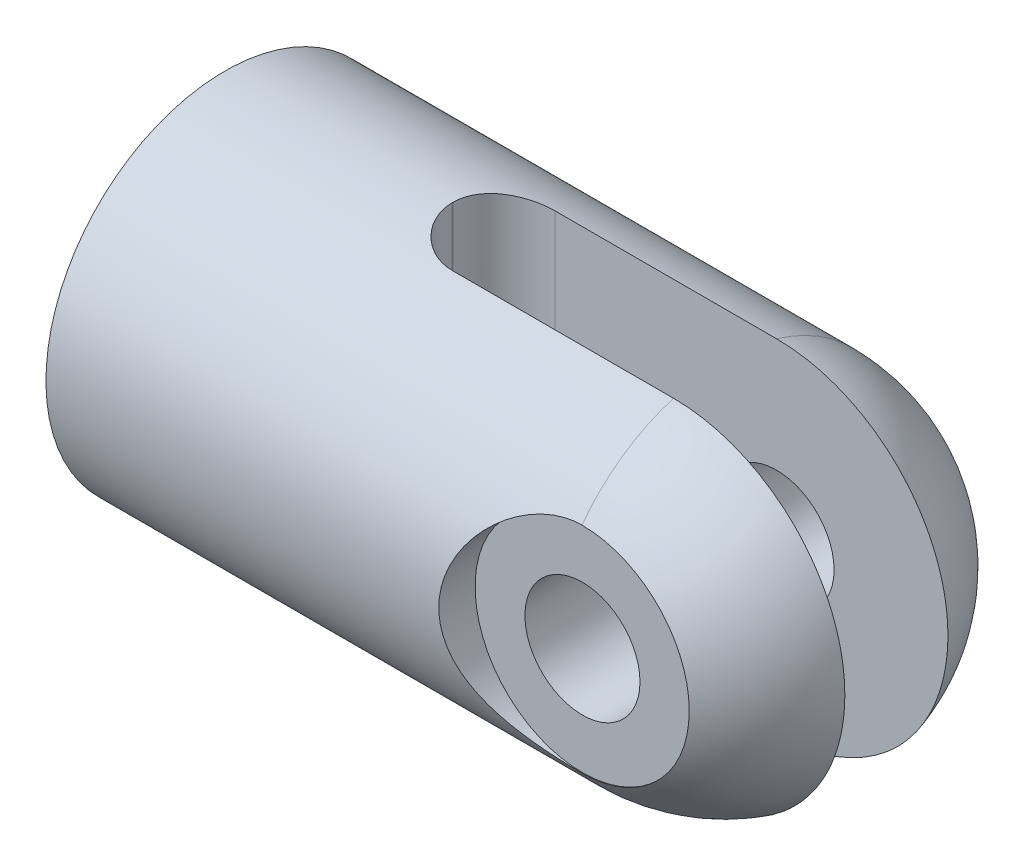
ISO-10303-21;
HEADER;
FILE_DESCRIPTION(('STEP AP214'),'2;1');
FILE_NAME('part.step','',(''),(''),'','','');
FILE_SCHEMA(('AUTOMOTIVE_DESIGN { 1 0 10303 214 1 1 1 1 }'));
ENDSEC;
DATA;
#1=APPLICATION_CONTEXT('core data for automotive mechanical design processes');
#2=APPLICATION_PROTOCOL_DEFINITION('international standard','automotive_design',2000,#1);
#3=PRODUCT_CONTEXT('',#1,'mechanical');
#4=PRODUCT('Part','Part','',(#3));
#5=PRODUCT_RELATED_PRODUCT_CATEGORY('part','',(#4));
#6=PRODUCT_DEFINITION_FORMATION('','',#4);
#7=PRODUCT_DEFINITION_CONTEXT('part definition',#1,'design');
#8=PRODUCT_DEFINITION('design','',#6,#7);
#9=PRODUCT_DEFINITION_SHAPE('','',#8);
#10=(LENGTH_UNIT() NAMED_UNIT(*) SI_UNIT(.MILLI.,.METRE.));
#11=(NAMED_UNIT(*) PLANE_ANGLE_UNIT() SI_UNIT($,.RADIAN.));
#12=(NAMED_UNIT(*) SI_UNIT($,.STERADIAN.) SOLID_ANGLE_UNIT());
#13=UNCERTAINTY_MEASURE_WITH_UNIT(LENGTH_MEASURE(1.E-05),#10,'distance_accuracy_value','');
#14=(GEOMETRIC_REPRESENTATION_CONTEXT(3) GLOBAL_UNCERTAINTY_ASSIGNED_CONTEXT((#13)) GLOBAL_UNIT_ASSIGNED_CONTEXT((#10,
#11,#12)) REPRESENTATION_CONTEXT('',''));
#15=CARTESIAN_POINT('',(0.,0.,0.));
#16=DIRECTION('',(0.,0.,1.));
#17=DIRECTION('',(1.,0.,0.));
#18=AXIS2_PLACEMENT_3D('',#15,#16,#17);
#19=CARTESIAN_POINT('',(7.1247,0.,0.));
#20=DIRECTION('',(-1.,0.,0.));
#21=DIRECTION('',(0.,-1.,0.));
#22=AXIS2_PLACEMENT_3D('',#19,#20,#21);
#23=SPHERICAL_SURFACE('',#22,7.9375);
#24=CARTESIAN_POINT('',(7.1247,0.,0.));
#25=DIRECTION('',(-1.,0.,0.));
#26=DIRECTION('',(0.,-1.,0.));
#27=AXIS2_PLACEMENT_3D('',#24,#25,#26);
#28=CIRCLE('',#27,7.9375);
#29=CARTESIAN_POINT('',(7.1247,4.7625,6.34999999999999));
#30=VERTEX_POINT('',#29);
#31=CARTESIAN_POINT('',(7.1247,7.60119137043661,2.286));
#32=VERTEX_POINT('',#31);
#33=EDGE_CURVE('E124',#30,#32,#28,.T.);
#34=ORIENTED_EDGE('',*,*,#33,.F.);
#35=CARTESIAN_POINT('',(7.1247,0.,6.34999999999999));
#36=DIRECTION('',(0.,0.,-1.));
#37=DIRECTION('',(-1.,0.,0.));
#38=AXIS2_PLACEMENT_3D('',#35,#36,#37);
#39=CIRCLE('',#38,4.7625);
#40=CARTESIAN_POINT('',(7.12470000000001,-4.7625,6.35));
#41=VERTEX_POINT('',#40);
#42=EDGE_CURVE('E63',#30,#41,#39,.T.);
#43=ORIENTED_EDGE('',*,*,#42,.T.);
#44=CARTESIAN_POINT('',(7.1247,-7.60119137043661,2.286));
#45=VERTEX_POINT('',#44);
#46=EDGE_CURVE('E126',#45,#41,#28,.T.);
#47=ORIENTED_EDGE('',*,*,#46,.F.);
#48=CARTESIAN_POINT('',(7.1247,0.,2.286));
#49=DIRECTION('',(0.,0.,1.));
#50=DIRECTION('',(1.,0.,0.));
#51=AXIS2_PLACEMENT_3D('',#48,#49,#50);
#52=CIRCLE('',#51,7.60119137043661);
#53=EDGE_CURVE('E196',#45,#32,#52,.T.);
#54=ORIENTED_EDGE('',*,*,#53,.T.);
#55=EDGE_LOOP('',(#34,#43,#47,#54));
#56=FACE_BOUND('',#55,.T.);
#57=ADVANCED_FACE('F38',(#56),#23,.T.);
#58=CARTESIAN_POINT('',(-15.0622,0.,0.));
#59=DIRECTION('',(1.,0.,0.));
#60=DIRECTION('',(0.,1.,0.));
#61=AXIS2_PLACEMENT_3D('',#58,#59,#60);
#62=PLANE('',#61);
#63=CARTESIAN_POINT('',(-15.0622,0.,0.));
#64=DIRECTION('',(-1.,0.,0.));
#65=DIRECTION('',(0.,0.,1.));
#66=AXIS2_PLACEMENT_3D('',#63,#64,#65);
#67=CIRCLE('',#66,2.5527);
#68=CARTESIAN_POINT('',(-15.0622,0.,2.5527));
#69=VERTEX_POINT('',#68);
#70=EDGE_CURVE('E237',#69,#69,#67,.T.);
#71=ORIENTED_EDGE('',*,*,#70,.F.);
#72=EDGE_LOOP('',(#71));
#73=FACE_BOUND('',#72,.T.);
#74=CARTESIAN_POINT('',(-15.0622,0.,0.));
#75=DIRECTION('',(-1.,0.,0.));
#76=DIRECTION('',(0.,-1.,0.));
#77=AXIS2_PLACEMENT_3D('',#74,#75,#76);
#78=CIRCLE('',#77,7.9375);
#79=CARTESIAN_POINT('',(-15.0622,-7.9375,0.));
#80=VERTEX_POINT('',#79);
#81=EDGE_CURVE('E127',#80,#80,#78,.T.);
#82=ORIENTED_EDGE('',*,*,#81,.T.);
#83=EDGE_LOOP('',(#82));
#84=FACE_BOUND('',#83,.T.);
#85=ADVANCED_FACE('F40',(#73,#84),#62,.F.);
#86=CARTESIAN_POINT('',(7.1247,-2.5527,-7.51582523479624));
#87=VERTEX_POINT('',#86);
#88=CARTESIAN_POINT('',(7.12470000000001,-7.60119137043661,-2.286));
#89=VERTEX_POINT('',#88);
#90=EDGE_CURVE('E116',#87,#89,#28,.T.);
#91=ORIENTED_EDGE('',*,*,#90,.F.);
#92=CARTESIAN_POINT('',(7.1247,0.,-7.51582523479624));
#93=DIRECTION('',(0.,0.,1.));
#94=DIRECTION('',(1.,0.,0.));
#95=AXIS2_PLACEMENT_3D('',#92,#93,#94);
#96=CIRCLE('',#95,2.5527);
#97=CARTESIAN_POINT('',(7.1247,2.5527,-7.51582523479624));
#98=VERTEX_POINT('',#97);
#99=EDGE_CURVE('E57',#87,#98,#96,.T.);
#100=ORIENTED_EDGE('',*,*,#99,.T.);
#101=CARTESIAN_POINT('',(7.1247,7.60119137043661,-2.286));
#102=VERTEX_POINT('',#101);
#103=EDGE_CURVE('E115',#102,#98,#28,.T.);
#104=ORIENTED_EDGE('',*,*,#103,.F.);
#105=CARTESIAN_POINT('',(7.1247,0.,-2.286));
#106=DIRECTION('',(0.,0.,-1.));
#107=DIRECTION('',(-1.,0.,0.));
#108=AXIS2_PLACEMENT_3D('',#105,#106,#107);
#109=CIRCLE('',#108,7.60119137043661);
#110=EDGE_CURVE('E193',#102,#89,#109,.T.);
#111=ORIENTED_EDGE('',*,*,#110,.T.);
#112=EDGE_LOOP('',(#91,#100,#104,#111));
#113=FACE_BOUND('',#112,.T.);
#114=ADVANCED_FACE('F113',(#113),#23,.T.);
#115=CARTESIAN_POINT('',(-15.0622,0.,0.));
#116=DIRECTION('',(-1.,0.,0.));
#117=DIRECTION('',(0.,-1.,0.));
#118=AXIS2_PLACEMENT_3D('',#115,#116,#117);
#119=CYLINDRICAL_SURFACE('',#118,7.9375);
#120=ORIENTED_EDGE('',*,*,#81,.F.);
#121=EDGE_LOOP('',(#120));
#122=FACE_BOUND('',#121,.T.);
#123=ORIENTED_EDGE('',*,*,#103,.T.);
#124=CARTESIAN_POINT('',(7.1247,2.5527,-7.51582523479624));
#125=CARTESIAN_POINT('',(7.05490396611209,2.55270902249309,-7.5158146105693));
#126=CARTESIAN_POINT('',(6.98511391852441,2.5498376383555,-7.51679723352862));
#127=CARTESIAN_POINT('',(6.84607197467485,2.53840431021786,-7.5206699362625));
#128=CARTESIAN_POINT('',(6.77681994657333,2.52984380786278,-7.52355953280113));
#129=CARTESIAN_POINT('',(6.63953672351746,2.50713425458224,-7.53115657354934));
#130=CARTESIAN_POINT('',(6.57150265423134,2.4930009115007,-7.53585890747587));
#131=CARTESIAN_POINT('',(6.436953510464,2.45928821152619,-7.54692788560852));
#132=CARTESIAN_POINT('',(6.37043848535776,2.4397086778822,-7.55329458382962));
#133=CARTESIAN_POINT('',(6.17392254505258,2.37305373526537,-7.57461051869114));
#134=CARTESIAN_POINT('',(6.04675794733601,2.31802971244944,-7.59178708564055));
#135=CARTESIAN_POINT('',(5.80345286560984,2.18852112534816,-7.63012555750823));
#136=CARTESIAN_POINT('',(5.68731860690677,2.11402565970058,-7.65128969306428));
#137=CARTESIAN_POINT('',(5.4651240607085,1.94478991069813,-7.69607646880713));
#138=CARTESIAN_POINT('',(5.35951946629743,1.84946546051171,-7.71975699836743));
#139=CARTESIAN_POINT('',(5.16548808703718,1.64252681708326,-7.76641796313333));
#140=CARTESIAN_POINT('',(5.07706430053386,1.53090978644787,-7.78939827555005));
#141=CARTESIAN_POINT('',(4.91785027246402,1.29123020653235,-7.83273852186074));
#142=CARTESIAN_POINT('',(4.84753640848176,1.1628361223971,-7.85302194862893));
#143=CARTESIAN_POINT('',(4.72968570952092,0.895285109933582,-7.88799968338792));
#144=CARTESIAN_POINT('',(4.68214231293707,0.756131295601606,-7.90269560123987));
#145=CARTESIAN_POINT('',(4.61272012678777,0.475814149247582,-7.92443165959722));
#146=CARTESIAN_POINT('',(4.59005623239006,0.334863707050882,-7.93170545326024));
#147=CARTESIAN_POINT('',(4.56854503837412,0.0509827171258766,-7.93860480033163));
#148=CARTESIAN_POINT('',(4.56969248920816,-0.0919473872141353,-7.93823203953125));
#149=CARTESIAN_POINT('',(4.59526378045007,-0.370186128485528,-7.93004079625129));
#150=CARTESIAN_POINT('',(4.61883545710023,-0.505582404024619,-7.92249491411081));
#151=CARTESIAN_POINT('',(4.68718277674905,-0.770382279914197,-7.90114370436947));
#152=CARTESIAN_POINT('',(4.73195957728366,-0.899785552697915,-7.88733803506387));
#153=CARTESIAN_POINT('',(4.84197220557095,-1.15085074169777,-7.85466052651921));
#154=CARTESIAN_POINT('',(4.90745983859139,-1.27239392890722,-7.83572676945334));
#155=CARTESIAN_POINT('',(5.05683077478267,-1.50302436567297,-7.79477796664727));
#156=CARTESIAN_POINT('',(5.14071877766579,-1.61210842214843,-7.77276213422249));
#157=CARTESIAN_POINT('',(5.32883955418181,-1.81979224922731,-7.72684123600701));
#158=CARTESIAN_POINT('',(5.43380404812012,-1.91772113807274,-7.7028956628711));
#159=CARTESIAN_POINT('',(5.65890650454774,-2.09481183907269,-7.65663571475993));
#160=CARTESIAN_POINT('',(5.77904915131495,-2.17396783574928,-7.63432184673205));
#161=CARTESIAN_POINT('',(6.03311530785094,-2.31212129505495,-7.59363371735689));
#162=CARTESIAN_POINT('',(6.16719729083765,-2.37084409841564,-7.57531428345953));
#163=CARTESIAN_POINT('',(6.4440104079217,-2.46459128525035,-7.54534011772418));
#164=CARTESIAN_POINT('',(6.58672768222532,-2.49965260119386,-7.53367500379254));
#165=CARTESIAN_POINT('',(6.79646539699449,-2.53236915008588,-7.52270597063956));
#166=CARTESIAN_POINT('',(6.86189675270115,-2.53999094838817,-7.52013238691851));
#167=CARTESIAN_POINT('',(6.99310729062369,-2.55015256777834,-7.5166912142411));
#168=CARTESIAN_POINT('',(7.05888587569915,-2.55269931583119,-7.5158212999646));
#169=CARTESIAN_POINT('',(7.1247,-2.5527,-7.51582523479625));
#170=B_SPLINE_CURVE_WITH_KNOTS('',3,(#124,#125,#126,#127,#128,#129,#130,#131,#132,#133,#134,
#135,#136,#137,#138,#139,#140,#141,#142,#143,#144,#145,#146,#147,#148,#149,#150,#151,#152,#153,
#154,#155,#156,#157,#158,#159,#160,#161,#162,#163,#164,#165,#166,#167,#168,#169),.UNSPECIFIED.,
.F.,.F.,(4,2,2,2,2,2,2,2,2,2,2,2,2,2,2,2,2,2,2,2,2,2,4),(0.,0.209312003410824,0.418570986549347,
0.627244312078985,0.835924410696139,1.25270448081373,1.6697183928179,2.1004180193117,
2.53119274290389,2.97235015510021,3.41338036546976,3.84005320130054,4.26663197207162,
4.67762150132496,5.0886334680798,5.50484822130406,5.92116940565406,6.35577525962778,
6.79051557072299,7.23089225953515,7.67057997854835,7.86816732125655,8.06548479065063),.UNSPECIFIED.);
#171=EDGE_CURVE('E11',#98,#87,#170,.T.);
#172=ORIENTED_EDGE('',*,*,#171,.T.);
#173=ORIENTED_EDGE('',*,*,#90,.T.);
#174=DIRECTION('',(-1.,0.,0.));
#175=VECTOR('',#174,1.);
#176=CARTESIAN_POINT('',(-15.0622,-7.60119137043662,-2.286));
#177=LINE('',#176,#175);
#178=CARTESIAN_POINT('',(-2.69850862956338,-7.60119137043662,-2.286));
#179=VERTEX_POINT('',#178);
#180=EDGE_CURVE('E162',#89,#179,#177,.T.);
#181=ORIENTED_EDGE('',*,*,#180,.T.);
#182=CARTESIAN_POINT('',(-2.69850862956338,-7.60119137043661,-2.286));
#183=CARTESIAN_POINT('',(-2.76067013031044,-7.60118320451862,-2.28600761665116));
#184=CARTESIAN_POINT('',(-2.82282685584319,-7.60196227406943,-2.28343618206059));
#185=CARTESIAN_POINT('',(-2.94666849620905,-7.60503422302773,-2.27319443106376));
#186=CARTESIAN_POINT('',(-3.00835350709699,-7.6073267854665,-2.2655251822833));
#187=CARTESIAN_POINT('',(-3.13066582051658,-7.61335770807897,-2.2451719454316));
#188=CARTESIAN_POINT('',(-3.19129534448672,-7.61709251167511,-2.23250029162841));
#189=CARTESIAN_POINT('',(-3.31120742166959,-7.62588889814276,-2.20226494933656));
#190=CARTESIAN_POINT('',(-3.37048994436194,-7.63095051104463,-2.18470115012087));
#191=CARTESIAN_POINT('',(-3.54567013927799,-7.64791014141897,-2.12488046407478));
#192=CARTESIAN_POINT('',(-3.65904488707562,-7.66159060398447,-2.07547000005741));
#193=CARTESIAN_POINT('',(-3.87589121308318,-7.69216265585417,-1.95911620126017));
#194=CARTESIAN_POINT('',(-3.97935836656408,-7.7090556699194,-1.89216508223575));
#195=CARTESIAN_POINT('',(-4.17648641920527,-7.74471393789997,-1.74055198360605));
#196=CARTESIAN_POINT('',(-4.26982025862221,-7.76351659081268,-1.65547276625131));
#197=CARTESIAN_POINT('',(-4.4411142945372,-7.8005883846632,-1.47090874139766));
#198=CARTESIAN_POINT('',(-4.51907144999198,-7.81885741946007,-1.3714210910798));
#199=CARTESIAN_POINT('',(-4.65886159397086,-7.85325923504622,-1.15847780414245));
#200=CARTESIAN_POINT('',(-4.72034829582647,-7.86934308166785,-1.04478645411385));
#201=CARTESIAN_POINT('',(-4.82316838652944,-7.89714519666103,-0.808176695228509));
#202=CARTESIAN_POINT('',(-4.86451867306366,-7.90886712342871,-0.685266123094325));
#203=CARTESIAN_POINT('',(-4.91630348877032,-7.92391569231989,-0.472357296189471));
#204=CARTESIAN_POINT('',(-4.9323244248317,-7.92871327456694,-0.383782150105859));
#205=CARTESIAN_POINT('',(-4.95373643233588,-7.93535363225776,-0.205290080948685));
#206=CARTESIAN_POINT('',(-4.95913229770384,-7.93719774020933,-0.115373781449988));
#207=CARTESIAN_POINT('',(-4.95910862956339,-7.93745935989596,-0.0253999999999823));
#208=B_SPLINE_CURVE_WITH_KNOTS('',3,(#182,#183,#184,#185,#186,#187,#188,#189,#190,#191,#192,
#193,#194,#195,#196,#197,#198,#199,#200,#201,#202,#203,#204,#205,#206,#207),.UNSPECIFIED.,.F.,
.F.,(4,2,2,2,2,2,2,2,2,2,2,2,4),(0.,0.18641829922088,0.372797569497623,0.558720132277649,
0.744646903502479,1.1160659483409,1.48765010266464,1.86894808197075,2.25032139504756,
2.63917568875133,3.02770310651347,3.29747512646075,3.56712540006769),.UNSPECIFIED.);
#209=CARTESIAN_POINT('',(-4.95910862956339,-7.93745935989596,-0.0253999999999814));
#210=VERTEX_POINT('',#209);
#211=EDGE_CURVE('E154',#179,#210,#208,.T.);
#212=ORIENTED_EDGE('',*,*,#211,.T.);
#213=CARTESIAN_POINT('',(-4.95910862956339,0.,0.));
#214=DIRECTION('',(-1.,0.,0.));
#215=DIRECTION('',(0.,0.,1.));
#216=AXIS2_PLACEMENT_3D('',#213,#214,#215);
#217=CIRCLE('',#216,7.9375);
#218=CARTESIAN_POINT('',(-4.95910862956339,-7.93745935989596,0.0253999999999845));
#219=VERTEX_POINT('',#218);
#220=EDGE_CURVE('E161',#210,#219,#217,.T.);
#221=ORIENTED_EDGE('',*,*,#220,.T.);
#222=CARTESIAN_POINT('',(-4.95910862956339,-7.93745935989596,0.025399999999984));
#223=CARTESIAN_POINT('',(-4.95911609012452,-7.93726698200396,0.0876849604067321));
#224=CARTESIAN_POINT('',(-4.95653460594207,-7.93632778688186,0.149962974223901));
#225=CARTESIAN_POINT('',(-4.94625287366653,-7.93300875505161,0.27404496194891));
#226=CARTESIAN_POINT('',(-4.93855359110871,-7.9306291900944,0.335849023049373));
#227=CARTESIAN_POINT('',(-4.9181189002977,-7.92448937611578,0.458405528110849));
#228=CARTESIAN_POINT('',(-4.90539512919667,-7.92073231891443,0.519160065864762));
#229=CARTESIAN_POINT('',(-4.87503396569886,-7.9119413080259,0.639317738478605));
#230=CARTESIAN_POINT('',(-4.85739648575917,-7.90690733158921,0.69872084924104));
#231=CARTESIAN_POINT('',(-4.7973180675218,-7.89007760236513,0.874264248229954));
#232=CARTESIAN_POINT('',(-4.74768874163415,-7.87654697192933,0.987871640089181));
#233=CARTESIAN_POINT('',(-4.63082240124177,-7.84625311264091,1.20511320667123));
#234=CARTESIAN_POINT('',(-4.56357869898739,-7.82948865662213,1.30874357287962));
#235=CARTESIAN_POINT('',(-4.41151087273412,-7.79400616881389,1.50586828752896));
#236=CARTESIAN_POINT('',(-4.32630788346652,-7.77525125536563,1.5990642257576));
#237=CARTESIAN_POINT('',(-4.14153842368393,-7.73811860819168,1.77005739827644));
#238=CARTESIAN_POINT('',(-4.04196843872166,-7.71974096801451,1.84785085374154));
#239=CARTESIAN_POINT('',(-3.82885840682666,-7.68503206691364,1.98732781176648));
#240=CARTESIAN_POINT('',(-3.71507886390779,-7.66874906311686,2.04865814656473));
#241=CARTESIAN_POINT('',(-3.47831134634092,-7.6406340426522,2.15115302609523));
#242=CARTESIAN_POINT('',(-3.35533187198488,-7.62879797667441,2.19233592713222));
#243=CARTESIAN_POINT('',(-3.14285397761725,-7.61381719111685,2.24369789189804));
#244=CARTESIAN_POINT('',(-3.05479165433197,-7.60911569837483,2.25953007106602));
#245=CARTESIAN_POINT('',(-2.87733999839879,-7.60278810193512,2.28069105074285));
#246=CARTESIAN_POINT('',(-2.78795115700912,-7.60116088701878,2.28602364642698));
#247=CARTESIAN_POINT('',(-2.69850862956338,-7.60119137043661,2.286));
#248=B_SPLINE_CURVE_WITH_KNOTS('',3,(#222,#223,#224,#225,#226,#227,#228,#229,#230,#231,#232,
#233,#234,#235,#236,#237,#238,#239,#240,#241,#242,#243,#244,#245,#246,#247),.UNSPECIFIED.,.F.,
.F.,(4,2,2,2,2,2,2,2,2,2,2,2,4),(0.,0.186790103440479,0.373544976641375,0.559869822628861,
0.746197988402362,1.11845412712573,1.49085180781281,1.87207478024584,2.2533911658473,
2.64233092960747,3.03091566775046,3.29906734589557,3.56712208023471),.UNSPECIFIED.);
#249=CARTESIAN_POINT('',(-2.69850862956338,-7.60119137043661,2.286));
#250=VERTEX_POINT('',#249);
#251=EDGE_CURVE('E164',#219,#250,#248,.T.);
#252=ORIENTED_EDGE('',*,*,#251,.T.);
#253=DIRECTION('',(-1.,0.,0.));
#254=VECTOR('',#253,1.);
#255=CARTESIAN_POINT('',(-15.0622,-7.60119137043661,2.286));
#256=LINE('',#255,#254);
#257=EDGE_CURVE('E170',#250,#45,#256,.F.);
#258=ORIENTED_EDGE('',*,*,#257,.T.);
#259=ORIENTED_EDGE('',*,*,#46,.T.);
#260=CARTESIAN_POINT('',(7.12470000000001,-4.7625,6.35));
#261=CARTESIAN_POINT('',(7.00425324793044,-4.76252689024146,6.34994899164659));
#262=CARTESIAN_POINT('',(6.88383644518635,-4.75793184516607,6.35342560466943));
#263=CARTESIAN_POINT('',(6.64418156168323,-4.73971171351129,6.36704575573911));
#264=CARTESIAN_POINT('',(6.52494244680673,-4.72609542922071,6.37718279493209));
#265=CARTESIAN_POINT('',(6.28946916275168,-4.69019014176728,6.4036306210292));
#266=CARTESIAN_POINT('',(6.17321858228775,-4.66797141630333,6.41989135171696));
#267=CARTESIAN_POINT('',(5.94355475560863,-4.61521384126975,6.45792276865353));
#268=CARTESIAN_POINT('',(5.83014208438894,-4.58467332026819,6.47969456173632));
#269=CARTESIAN_POINT('',(5.49603692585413,-4.48140423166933,6.55194493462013));
#270=CARTESIAN_POINT('',(5.28040589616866,-4.39685984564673,6.60949085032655));
#271=CARTESIAN_POINT('',(4.86623737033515,-4.19924468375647,6.73676749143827));
#272=CARTESIAN_POINT('',(4.66774006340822,-4.08610915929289,6.80652576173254));
#273=CARTESIAN_POINT('',(4.26733923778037,-3.81859690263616,6.96052033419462));
#274=CARTESIAN_POINT('',(4.06794660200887,-3.66088119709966,7.04548623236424));
#275=CARTESIAN_POINT('',(3.69635108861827,-3.31544111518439,7.21447701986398));
#276=CARTESIAN_POINT('',(3.52415798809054,-3.12770599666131,7.29850156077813));
#277=CARTESIAN_POINT('',(3.28047174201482,-2.81484414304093,7.42260313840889));
#278=CARTESIAN_POINT('',(3.1982777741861,-2.69905700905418,7.46559074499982));
#279=CARTESIAN_POINT('',(3.04405489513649,-2.45967323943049,7.54784081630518));
#280=CARTESIAN_POINT('',(2.97202178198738,-2.33607986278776,7.58710481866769));
#281=CARTESIAN_POINT('',(2.8389029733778,-2.08181109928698,7.66077583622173));
#282=CARTESIAN_POINT('',(2.77781300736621,-1.95113850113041,7.6951847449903));
#283=CARTESIAN_POINT('',(2.66735261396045,-1.68356671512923,7.75811726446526));
#284=CARTESIAN_POINT('',(2.61798025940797,-1.54666855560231,7.78664184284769));
#285=CARTESIAN_POINT('',(2.53583838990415,-1.28108993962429,7.83448450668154));
#286=CARTESIAN_POINT('',(2.50193431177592,-1.15287144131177,7.8544212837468));
#287=CARTESIAN_POINT('',(2.4448388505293,-0.893285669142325,7.88816001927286));
#288=CARTESIAN_POINT('',(2.42164585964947,-0.76191887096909,7.90196289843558));
#289=CARTESIAN_POINT('',(2.38635363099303,-0.497279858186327,7.92301873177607));
#290=CARTESIAN_POINT('',(2.37424623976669,-0.364009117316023,7.93027649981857));
#291=CARTESIAN_POINT('',(2.36130363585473,-0.0967303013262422,7.93803608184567));
#292=CARTESIAN_POINT('',(2.36046727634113,0.0372776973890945,7.93853858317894));
#293=CARTESIAN_POINT('',(2.36947711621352,0.288091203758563,7.93313536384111));
#294=CARTESIAN_POINT('',(2.37800795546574,0.404963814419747,7.92801868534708));
#295=CARTESIAN_POINT('',(2.40360694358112,0.637470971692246,7.9127185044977));
#296=CARTESIAN_POINT('',(2.4206776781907,0.753105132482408,7.90253346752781));
#297=CARTESIAN_POINT('',(2.46313969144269,0.982258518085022,7.87733148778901));
#298=CARTESIAN_POINT('',(2.48852810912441,1.09577845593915,7.86231620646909));
#299=CARTESIAN_POINT('',(2.54732464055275,1.32003860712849,7.82779064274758));
#300=CARTESIAN_POINT('',(2.58073584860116,1.43077772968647,7.80827862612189));
#301=CARTESIAN_POINT('',(2.69289717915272,1.75899932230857,7.7433577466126));
#302=CARTESIAN_POINT('',(2.78336649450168,1.97137862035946,7.69169138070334));
#303=CARTESIAN_POINT('',(2.99208411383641,2.37808189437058,7.57584995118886));
#304=CARTESIAN_POINT('',(3.11033883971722,2.57240168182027,7.51167199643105));
#305=CARTESIAN_POINT('',(3.38718574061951,2.96246757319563,7.36721863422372));
#306=CARTESIAN_POINT('',(3.54890733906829,3.1556173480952,7.28593619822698));
#307=CARTESIAN_POINT('',(3.90016402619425,3.51380209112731,7.12012049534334));
#308=CARTESIAN_POINT('',(4.08974372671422,3.67879102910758,7.03558217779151));
#309=CARTESIAN_POINT('',(4.40438435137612,3.91164664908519,6.90739040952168));
#310=CARTESIAN_POINT('',(4.52100718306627,3.99024702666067,6.86215479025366));
#311=CARTESIAN_POINT('',(4.76160704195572,4.13727806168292,6.77452225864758));
#312=CARTESIAN_POINT('',(4.88558604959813,4.20570596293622,6.7321261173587));
#313=CARTESIAN_POINT('',(5.13992735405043,4.33153054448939,6.65186498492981));
#314=CARTESIAN_POINT('',(5.27026929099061,4.3889598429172,6.61398672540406));
#315=CARTESIAN_POINT('',(5.5369093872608,4.49229780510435,6.54423836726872));
#316=CARTESIAN_POINT('',(5.67320255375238,4.53821591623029,6.51236334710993));
#317=CARTESIAN_POINT('',(5.91691504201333,4.60809926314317,6.46302432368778));
#318=CARTESIAN_POINT('',(6.02326118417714,4.63468717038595,6.44394186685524));
#319=CARTESIAN_POINT('',(6.23825123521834,4.68056526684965,6.41069531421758));
#320=CARTESIAN_POINT('',(6.34689437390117,4.69985786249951,6.39652959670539));
#321=CARTESIAN_POINT('',(6.56657262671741,4.73099089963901,6.37354154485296));
#322=CARTESIAN_POINT('',(6.67761898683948,4.74277973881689,6.36475622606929));
#323=CARTESIAN_POINT('',(6.90066970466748,4.75854831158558,6.35296330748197));
#324=CARTESIAN_POINT('',(7.01267485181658,4.76252082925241,6.34996104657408));
#325=CARTESIAN_POINT('',(7.1247,4.7625,6.35));
#326=B_SPLINE_CURVE_WITH_KNOTS('',3,(#260,#261,#262,#263,#264,#265,#266,#267,#268,#269,#270,
#271,#272,#273,#274,#275,#276,#277,#278,#279,#280,#281,#282,#283,#284,#285,#286,#287,#288,#289,
#290,#291,#292,#293,#294,#295,#296,#297,#298,#299,#300,#301,#302,#303,#304,#305,#306,#307,#308,
#309,#310,#311,#312,#313,#314,#315,#316,#317,#318,#319,#320,#321,#322,#323,#324,#325),
.UNSPECIFIED.,.F.,.F.,(4,2,2,2,2,2,2,2,2,2,2,2,2,2,2,2,2,2,2,2,2,2,2,2,2,2,2,2,2,2,2,2,4),(0.,
0.36115395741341,0.721956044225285,1.07987071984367,1.43785733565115,2.15059444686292,
2.86496034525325,3.6660335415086,4.46739403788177,4.91196445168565,5.35635047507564,
5.80056269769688,6.24470181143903,6.64647017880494,7.04817822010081,7.4495905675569,
7.85096207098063,8.20242622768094,8.55399686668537,8.90544670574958,9.25703231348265,
9.96356592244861,10.6702629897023,11.4612821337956,12.2535821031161,12.6963141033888,
13.1391658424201,13.5806831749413,14.0218369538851,14.3553017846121,14.6886565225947,
15.0242796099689,15.3602123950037),.UNSPECIFIED.);
#327=EDGE_CURVE('E51',#41,#30,#326,.T.);
#328=ORIENTED_EDGE('',*,*,#327,.T.);
#329=ORIENTED_EDGE('',*,*,#33,.T.);
#330=DIRECTION('',(-1.,0.,0.));
#331=VECTOR('',#330,1.);
#332=CARTESIAN_POINT('',(-15.0622,7.60119137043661,2.286));
#333=LINE('',#332,#331);
#334=CARTESIAN_POINT('',(-2.69850862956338,7.60119137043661,2.286));
#335=VERTEX_POINT('',#334);
#336=EDGE_CURVE('E185',#32,#335,#333,.T.);
#337=ORIENTED_EDGE('',*,*,#336,.T.);
#338=CARTESIAN_POINT('',(-2.69850862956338,7.60119137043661,2.286));
#339=CARTESIAN_POINT('',(-2.76067013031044,7.60118320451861,2.28600761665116));
#340=CARTESIAN_POINT('',(-2.82282685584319,7.60196227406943,2.28343618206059));
#341=CARTESIAN_POINT('',(-2.94666849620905,7.60503422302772,2.27319443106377));
#342=CARTESIAN_POINT('',(-3.00835350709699,7.6073267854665,2.2655251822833));
#343=CARTESIAN_POINT('',(-3.13066582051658,7.61335770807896,2.2451719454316));
#344=CARTESIAN_POINT('',(-3.19129534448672,7.61709251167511,2.23250029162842));
#345=CARTESIAN_POINT('',(-3.31120742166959,7.62588889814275,2.20226494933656));
#346=CARTESIAN_POINT('',(-3.37048994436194,7.63095051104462,2.18470115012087));
#347=CARTESIAN_POINT('',(-3.54567013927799,7.64791014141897,2.12488046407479));
#348=CARTESIAN_POINT('',(-3.65904488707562,7.66159060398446,2.07547000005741));
#349=CARTESIAN_POINT('',(-3.87589121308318,7.69216265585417,1.95911620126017));
#350=CARTESIAN_POINT('',(-3.97935836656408,7.7090556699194,1.89216508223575));
#351=CARTESIAN_POINT('',(-4.17648641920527,7.74471393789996,1.74055198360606));
#352=CARTESIAN_POINT('',(-4.2698202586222,7.76351659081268,1.65547276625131));
#353=CARTESIAN_POINT('',(-4.4411142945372,7.8005883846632,1.47090874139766));
#354=CARTESIAN_POINT('',(-4.51907144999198,7.81885741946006,1.3714210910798));
#355=CARTESIAN_POINT('',(-4.65886159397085,7.85325923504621,1.15847780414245));
#356=CARTESIAN_POINT('',(-4.72034829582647,7.86934308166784,1.04478645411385));
#357=CARTESIAN_POINT('',(-4.82316838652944,7.89714519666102,0.808176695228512));
#358=CARTESIAN_POINT('',(-4.86451867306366,7.90886712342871,0.685266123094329));
#359=CARTESIAN_POINT('',(-4.91630348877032,7.92391569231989,0.472357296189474));
#360=CARTESIAN_POINT('',(-4.9323244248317,7.92871327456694,0.383782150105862));
#361=CARTESIAN_POINT('',(-4.95373643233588,7.93535363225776,0.205290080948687));
#362=CARTESIAN_POINT('',(-4.95913229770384,7.93719774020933,0.11537378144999));
#363=CARTESIAN_POINT('',(-4.95910862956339,7.93745935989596,0.0253999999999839));
#364=B_SPLINE_CURVE_WITH_KNOTS('',3,(#338,#339,#340,#341,#342,#343,#344,#345,#346,#347,#348,
#349,#350,#351,#352,#353,#354,#355,#356,#357,#358,#359,#360,#361,#362,#363),.UNSPECIFIED.,.F.,
.F.,(4,2,2,2,2,2,2,2,2,2,2,2,4),(0.,0.18641829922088,0.372797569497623,0.558720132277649,
0.744646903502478,1.1160659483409,1.48765010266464,1.86894808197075,2.25032139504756,
2.63917568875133,3.02770310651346,3.29747512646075,3.56712540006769),.UNSPECIFIED.);
#365=CARTESIAN_POINT('',(-4.95910862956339,7.93745935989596,0.0253999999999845));
#366=VERTEX_POINT('',#365);
#367=EDGE_CURVE('E180',#335,#366,#364,.T.);
#368=ORIENTED_EDGE('',*,*,#367,.T.);
#369=CARTESIAN_POINT('',(-4.95910862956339,7.93745935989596,-0.0253999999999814));
#370=VERTEX_POINT('',#369);
#371=EDGE_CURVE('E134',#366,#370,#217,.T.);
#372=ORIENTED_EDGE('',*,*,#371,.T.);
#373=CARTESIAN_POINT('',(-4.95910862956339,7.93745935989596,-0.0253999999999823));
#374=CARTESIAN_POINT('',(-4.95911609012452,7.93726698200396,-0.0876849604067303));
#375=CARTESIAN_POINT('',(-4.95653460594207,7.93632778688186,-0.149962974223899));
#376=CARTESIAN_POINT('',(-4.94625287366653,7.9330087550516,-0.274044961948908));
#377=CARTESIAN_POINT('',(-4.93855359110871,7.9306291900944,-0.335849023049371));
#378=CARTESIAN_POINT('',(-4.9181189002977,7.92448937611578,-0.458405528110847));
#379=CARTESIAN_POINT('',(-4.90539512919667,7.92073231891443,-0.51916006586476));
#380=CARTESIAN_POINT('',(-4.87503396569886,7.9119413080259,-0.639317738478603));
#381=CARTESIAN_POINT('',(-4.85739648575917,7.9069073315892,-0.698720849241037));
#382=CARTESIAN_POINT('',(-4.7973180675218,7.89007760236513,-0.874264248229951));
#383=CARTESIAN_POINT('',(-4.74768874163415,7.87654697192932,-0.987871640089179));
#384=CARTESIAN_POINT('',(-4.63082240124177,7.8462531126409,-1.20511320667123));
#385=CARTESIAN_POINT('',(-4.56357869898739,7.82948865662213,-1.30874357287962));
#386=CARTESIAN_POINT('',(-4.41151087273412,7.79400616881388,-1.50586828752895));
#387=CARTESIAN_POINT('',(-4.32630788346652,7.77525125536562,-1.59906422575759));
#388=CARTESIAN_POINT('',(-4.14153842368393,7.73811860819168,-1.77005739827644));
#389=CARTESIAN_POINT('',(-4.04196843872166,7.71974096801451,-1.84785085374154));
#390=CARTESIAN_POINT('',(-3.82885840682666,7.68503206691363,-1.98732781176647));
#391=CARTESIAN_POINT('',(-3.71507886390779,7.66874906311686,-2.04865814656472));
#392=CARTESIAN_POINT('',(-3.47831134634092,7.6406340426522,-2.15115302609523));
#393=CARTESIAN_POINT('',(-3.35533187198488,7.62879797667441,-2.19233592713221));
#394=CARTESIAN_POINT('',(-3.14285397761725,7.61381719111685,-2.24369789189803));
#395=CARTESIAN_POINT('',(-3.05479165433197,7.60911569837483,-2.25953007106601));
#396=CARTESIAN_POINT('',(-2.87733999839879,7.60278810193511,-2.28069105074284));
#397=CARTESIAN_POINT('',(-2.78795115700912,7.60116088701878,-2.28602364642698));
#398=CARTESIAN_POINT('',(-2.69850862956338,7.60119137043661,-2.286));
#399=B_SPLINE_CURVE_WITH_KNOTS('',3,(#373,#374,#375,#376,#377,#378,#379,#380,#381,#382,#383,
#384,#385,#386,#387,#388,#389,#390,#391,#392,#393,#394,#395,#396,#397,#398),.UNSPECIFIED.,.F.,
.F.,(4,2,2,2,2,2,2,2,2,2,2,2,4),(0.,0.186790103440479,0.373544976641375,0.559869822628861,
0.746197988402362,1.11845412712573,1.49085180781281,1.87207478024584,2.2533911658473,
2.64233092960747,3.03091566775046,3.29906734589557,3.5671220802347),.UNSPECIFIED.);
#400=CARTESIAN_POINT('',(-2.69850862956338,7.6011913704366,-2.286));
#401=VERTEX_POINT('',#400);
#402=EDGE_CURVE('E133',#370,#401,#399,.T.);
#403=ORIENTED_EDGE('',*,*,#402,.T.);
#404=DIRECTION('',(-1.,0.,0.));
#405=VECTOR('',#404,1.);
#406=CARTESIAN_POINT('',(-15.0622,7.60119137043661,-2.286));
#407=LINE('',#406,#405);
#408=EDGE_CURVE('E123',#401,#102,#407,.F.);
#409=ORIENTED_EDGE('',*,*,#408,.T.);
#410=EDGE_LOOP('',(#123,#172,#173,#181,#212,#221,#252,#258,#259,#328,#329,#337,#368,#372,#403,#409));
#411=FACE_BOUND('',#410,.T.);
#412=ADVANCED_FACE('F121',(#122,#411),#119,.T.);
#413=CARTESIAN_POINT('',(14.7258913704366,-127.,2.286));
#414=DIRECTION('',(0.,0.,1.));
#415=DIRECTION('',(1.,0.,0.));
#416=AXIS2_PLACEMENT_3D('',#413,#414,#415);
#417=PLANE('',#416);
#418=CARTESIAN_POINT('',(7.1247,0.,2.286));
#419=DIRECTION('',(0.,0.,1.));
#420=DIRECTION('',(1.,0.,0.));
#421=AXIS2_PLACEMENT_3D('',#418,#419,#420);
#422=CIRCLE('',#421,2.55269999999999);
#423=CARTESIAN_POINT('',(9.6774,0.,2.286));
#424=VERTEX_POINT('',#423);
#425=EDGE_CURVE('E244',#424,#424,#422,.T.);
#426=ORIENTED_EDGE('',*,*,#425,.T.);
#427=EDGE_LOOP('',(#426));
#428=FACE_BOUND('',#427,.T.);
#429=ORIENTED_EDGE('',*,*,#53,.F.);
#430=ORIENTED_EDGE('',*,*,#257,.F.);
#431=DIRECTION('',(0.,1.,0.));
#432=VECTOR('',#431,1.);
#433=CARTESIAN_POINT('',(-2.69850862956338,-127.,2.286));
#434=LINE('',#433,#432);
#435=EDGE_CURVE('E197',#250,#335,#434,.T.);
#436=ORIENTED_EDGE('',*,*,#435,.T.);
#437=ORIENTED_EDGE('',*,*,#336,.F.);
#438=EDGE_LOOP('',(#429,#430,#436,#437));
#439=FACE_BOUND('',#438,.T.);
#440=ADVANCED_FACE('F176',(#428,#439),#417,.F.);
#441=CARTESIAN_POINT('',(-2.69850862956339,-127.,0.0254000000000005));
#442=DIRECTION('',(0.,1.,0.));
#443=DIRECTION('',(0.,0.,1.));
#444=AXIS2_PLACEMENT_3D('',#441,#442,#443);
#445=CYLINDRICAL_SURFACE('',#444,2.2606);
#446=ORIENTED_EDGE('',*,*,#435,.F.);
#447=ORIENTED_EDGE('',*,*,#251,.F.);
#448=DIRECTION('',(0.,1.,0.));
#449=VECTOR('',#448,1.);
#450=CARTESIAN_POINT('',(-4.95910862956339,-127.,0.0253999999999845));
#451=LINE('',#450,#449);
#452=EDGE_CURVE('E202',#219,#366,#451,.T.);
#453=ORIENTED_EDGE('',*,*,#452,.T.);
#454=ORIENTED_EDGE('',*,*,#367,.F.);
#455=EDGE_LOOP('',(#446,#447,#453,#454));
#456=FACE_BOUND('',#455,.T.);
#457=ADVANCED_FACE('F172',(#456),#445,.F.);
#458=CARTESIAN_POINT('',(-4.95910862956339,-127.,0.0253999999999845));
#459=DIRECTION('',(-1.,0.,0.));
#460=DIRECTION('',(0.,0.,1.));
#461=AXIS2_PLACEMENT_3D('',#458,#459,#460);
#462=PLANE('',#461);
#463=ORIENTED_EDGE('',*,*,#452,.F.);
#464=ORIENTED_EDGE('',*,*,#220,.F.);
#465=DIRECTION('',(0.,1.,0.));
#466=VECTOR('',#465,1.);
#467=CARTESIAN_POINT('',(-4.95910862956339,-127.,-0.0253999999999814));
#468=LINE('',#467,#466);
#469=EDGE_CURVE('E231',#210,#370,#468,.T.);
#470=ORIENTED_EDGE('',*,*,#469,.T.);
#471=ORIENTED_EDGE('',*,*,#371,.F.);
#472=EDGE_LOOP('',(#463,#464,#470,#471));
#473=FACE_BOUND('',#472,.T.);
#474=ADVANCED_FACE('F149',(#473),#462,.F.);
#475=CARTESIAN_POINT('',(-2.69850862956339,-127.,-0.0253999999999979));
#476=DIRECTION('',(0.,1.,0.));
#477=DIRECTION('',(0.,0.,1.));
#478=AXIS2_PLACEMENT_3D('',#475,#476,#477);
#479=CYLINDRICAL_SURFACE('',#478,2.2606);
#480=ORIENTED_EDGE('',*,*,#469,.F.);
#481=ORIENTED_EDGE('',*,*,#211,.F.);
#482=DIRECTION('',(0.,1.,0.));
#483=VECTOR('',#482,1.);
#484=CARTESIAN_POINT('',(-2.69850862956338,-127.,-2.286));
#485=LINE('',#484,#483);
#486=EDGE_CURVE('E195',#179,#401,#485,.T.);
#487=ORIENTED_EDGE('',*,*,#486,.T.);
#488=ORIENTED_EDGE('',*,*,#402,.F.);
#489=EDGE_LOOP('',(#480,#481,#487,#488));
#490=FACE_BOUND('',#489,.T.);
#491=ADVANCED_FACE('F144',(#490),#479,.F.);
#492=CARTESIAN_POINT('',(14.7258913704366,-127.,-2.286));
#493=DIRECTION('',(0.,0.,-1.));
#494=DIRECTION('',(-1.,0.,0.));
#495=AXIS2_PLACEMENT_3D('',#492,#493,#494);
#496=PLANE('',#495);
#497=CARTESIAN_POINT('',(7.1247,0.,-2.286));
#498=DIRECTION('',(0.,0.,1.));
#499=DIRECTION('',(1.,0.,0.));
#500=AXIS2_PLACEMENT_3D('',#497,#498,#499);
#501=CIRCLE('',#500,2.5527);
#502=CARTESIAN_POINT('',(9.6774,0.,-2.286));
#503=VERTEX_POINT('',#502);
#504=EDGE_CURVE('E118',#503,#503,#501,.T.);
#505=ORIENTED_EDGE('',*,*,#504,.F.);
#506=EDGE_LOOP('',(#505));
#507=FACE_BOUND('',#506,.T.);
#508=ORIENTED_EDGE('',*,*,#110,.F.);
#509=ORIENTED_EDGE('',*,*,#408,.F.);
#510=ORIENTED_EDGE('',*,*,#486,.F.);
#511=ORIENTED_EDGE('',*,*,#180,.F.);
#512=EDGE_LOOP('',(#508,#509,#510,#511));
#513=FACE_BOUND('',#512,.T.);
#514=ADVANCED_FACE('F148',(#507,#513),#496,.F.);
#515=CARTESIAN_POINT('',(-8.0772,0.,0.));
#516=DIRECTION('',(-1.,0.,0.));
#517=DIRECTION('',(0.,0.,1.));
#518=AXIS2_PLACEMENT_3D('',#515,#516,#517);
#519=CONICAL_SURFACE('',#518,2.5527,1.02974425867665);
#520=CARTESIAN_POINT('',(-6.54338309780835,0.,0.));
#521=VERTEX_POINT('',#520);
#522=VERTEX_LOOP('',#521);
#523=FACE_BOUND('',#522,.T.);
#524=CARTESIAN_POINT('',(-8.0772,0.,0.));
#525=DIRECTION('',(-1.,0.,0.));
#526=DIRECTION('',(0.,0.,1.));
#527=AXIS2_PLACEMENT_3D('',#524,#525,#526);
#528=CIRCLE('',#527,2.5527);
#529=CARTESIAN_POINT('',(-8.0772,0.,2.5527));
#530=VERTEX_POINT('',#529);
#531=EDGE_CURVE('E234',#530,#530,#528,.T.);
#532=ORIENTED_EDGE('',*,*,#531,.T.);
#533=EDGE_LOOP('',(#532));
#534=FACE_BOUND('',#533,.T.);
#535=ADVANCED_FACE('F252',(#523,#534),#519,.F.);
#536=CARTESIAN_POINT('',(-15.0622,0.,0.));
#537=DIRECTION('',(-1.,0.,0.));
#538=DIRECTION('',(0.,0.,1.));
#539=AXIS2_PLACEMENT_3D('',#536,#537,#538);
#540=CYLINDRICAL_SURFACE('',#539,2.5527);
#541=ORIENTED_EDGE('',*,*,#531,.F.);
#542=EDGE_LOOP('',(#541));
#543=FACE_BOUND('',#542,.T.);
#544=ORIENTED_EDGE('',*,*,#70,.T.);
#545=EDGE_LOOP('',(#544));
#546=FACE_BOUND('',#545,.T.);
#547=ADVANCED_FACE('F256',(#543,#546),#540,.F.);
#548=CARTESIAN_POINT('',(7.1247,0.,6.3246));
#549=DIRECTION('',(0.,0.,1.));
#550=DIRECTION('',(1.,0.,0.));
#551=AXIS2_PLACEMENT_3D('',#548,#549,#550);
#552=CYLINDRICAL_SURFACE('',#551,4.7625);
#553=CARTESIAN_POINT('',(7.1247,0.,6.3246));
#554=DIRECTION('',(0.,0.,1.));
#555=DIRECTION('',(1.,0.,0.));
#556=AXIS2_PLACEMENT_3D('',#553,#554,#555);
#557=CIRCLE('',#556,4.7625);
#558=CARTESIAN_POINT('',(11.8872,0.,6.3246));
#559=VERTEX_POINT('',#558);
#560=EDGE_CURVE('E241',#559,#559,#557,.T.);
#561=ORIENTED_EDGE('',*,*,#560,.F.);
#562=EDGE_LOOP('',(#561));
#563=FACE_BOUND('',#562,.T.);
#564=ORIENTED_EDGE('',*,*,#327,.F.);
#565=ORIENTED_EDGE('',*,*,#42,.F.);
#566=EDGE_LOOP('',(#564,#565));
#567=FACE_BOUND('',#566,.T.);
#568=ADVANCED_FACE('F261',(#563,#567),#552,.F.);
#569=CARTESIAN_POINT('',(7.1247,0.,6.3246));
#570=DIRECTION('',(0.,0.,1.));
#571=DIRECTION('',(1.,0.,0.));
#572=AXIS2_PLACEMENT_3D('',#569,#570,#571);
#573=PLANE('',#572);
#574=CARTESIAN_POINT('',(7.1247,0.,6.3246));
#575=DIRECTION('',(0.,0.,1.));
#576=DIRECTION('',(1.,0.,0.));
#577=AXIS2_PLACEMENT_3D('',#574,#575,#576);
#578=CIRCLE('',#577,2.55269999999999);
#579=CARTESIAN_POINT('',(9.67739999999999,0.,6.3246));
#580=VERTEX_POINT('',#579);
#581=EDGE_CURVE('E117',#580,#580,#578,.T.);
#582=ORIENTED_EDGE('',*,*,#581,.F.);
#583=EDGE_LOOP('',(#582));
#584=FACE_BOUND('',#583,.T.);
#585=ORIENTED_EDGE('',*,*,#560,.T.);
#586=EDGE_LOOP('',(#585));
#587=FACE_BOUND('',#586,.T.);
#588=ADVANCED_FACE('F269',(#584,#587),#573,.T.);
#589=CARTESIAN_POINT('',(7.1247,0.,6.3246));
#590=DIRECTION('',(0.,0.,1.));
#591=DIRECTION('',(1.,0.,0.));
#592=AXIS2_PLACEMENT_3D('',#589,#590,#591);
#593=CYLINDRICAL_SURFACE('',#592,2.55269999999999);
#594=ORIENTED_EDGE('',*,*,#581,.T.);
#595=EDGE_LOOP('',(#594));
#596=FACE_BOUND('',#595,.T.);
#597=ORIENTED_EDGE('',*,*,#425,.F.);
#598=EDGE_LOOP('',(#597));
#599=FACE_BOUND('',#598,.T.);
#600=ADVANCED_FACE('F278',(#596,#599),#593,.F.);
#601=CARTESIAN_POINT('',(7.1247,0.,-2.286));
#602=DIRECTION('',(0.,0.,1.));
#603=DIRECTION('',(1.,0.,0.));
#604=AXIS2_PLACEMENT_3D('',#601,#602,#603);
#605=CYLINDRICAL_SURFACE('',#604,2.5527);
#606=ORIENTED_EDGE('',*,*,#504,.T.);
#607=EDGE_LOOP('',(#606));
#608=FACE_BOUND('',#607,.T.);
#609=ORIENTED_EDGE('',*,*,#171,.F.);
#610=ORIENTED_EDGE('',*,*,#99,.F.);
#611=EDGE_LOOP('',(#609,#610));
#612=FACE_BOUND('',#611,.T.);
#613=ADVANCED_FACE('F107',(#608,#612),#605,.F.);
#614=CLOSED_SHELL('',(#57,#85,#114,#412,#440,#457,#474,#491,#514,#535,#547,#568,#588,#600,#613));
#615=MANIFOLD_SOLID_BREP('B2',#614);
#616=ADVANCED_BREP_SHAPE_REPRESENTATION('',(#18,#615),#14);
#617=SHAPE_DEFINITION_REPRESENTATION(#9,#616);
ENDSEC;
END-ISO-10303-21;
